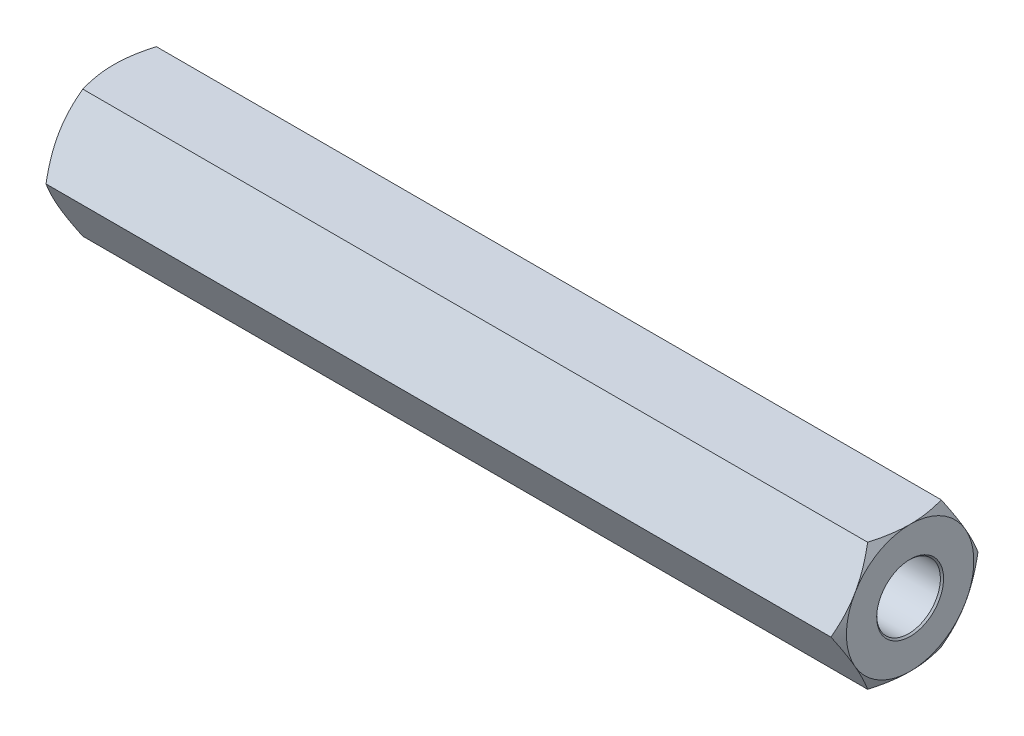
from build123d import *

# Parameters (mm, degrees)
BOSS_EXTRUDE1_DEPTH = 50
SKETCH4_OUTSIDE_W   = 199.49
SKETCH4_OUTSIDE_H   = 198.252
SKETCH4_OUTSIDE_R   = 4
CUT_EXTRUDE1_DEPTH  = 51.371949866
CUT_EXTRUDE1_DRAFT  = -60
SKETCH5_OUTSIDE_W   = 199.49
SKETCH5_OUTSIDE_H   = 198.252
SKETCH5_OUTSIDE_R   = 4
CUT_EXTRUDE2_DEPTH  = 51.371949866
CUT_EXTRUDE2_DRAFT  = -60


with BuildPart() as part:
    # Sketch2 → Boss-Extrude1 (new body)
    with BuildSketch(Plane(origin=(0, 0, 0), x_dir=(0, 0, -1), z_dir=(1, 0, 0))):
        Polygon((2.309401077, 4), (-2.309401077, 4), (-4.618802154, 0), (-2.309401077, -4), (2.309401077, -4), (4.618802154, 0), align=None)
    extrude(amount=BOSS_EXTRUDE1_DEPTH)

    # Sketch3 → Cut-Revolve1 (revolve, cut)
    with BuildSketch(Plane.XY, mode=Mode.PRIVATE) as cut_revolve1_sk:
        Polygon((0, 2.1), (0.1, 2), (11.1, 2), (11.1, 0), (0, 0), align=None)
        Polygon((50, 0), (38.9, 0), (38.9, 2), (49.9, 2), (50, 2.1), align=None)
    revolve(cut_revolve1_sk.sketch.rotate(Axis((0, 0, 0), (1, 0, 0)), 180), axis=Axis((0, 0, 0), (1, 0, 0)), mode=Mode.SUBTRACT)


with BuildPart() as cut_extrude1_tool:
    # Sketch4 outside → Cut-Extrude1 (with draft: the straight prism first)
    with BuildSketch(Plane.ZY):
        Rectangle(SKETCH4_OUTSIDE_W, SKETCH4_OUTSIDE_H)
        Circle(SKETCH4_OUTSIDE_R, mode=Mode.SUBTRACT)
    extrude(amount=-CUT_EXTRUDE1_DEPTH)
    # Cut-Extrude1: the draft: its side faces are tilted about the plane it starts from
    cut_extrude1_sides = [cut_extrude1_tool.faces().sort_by_distance(p)[0] for p in [
        (25.685974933, -99.126, 0),
        (25.685974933, 0, 99.745),
        (25.685974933, 99.126, 0),
        (25.685974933, 0, -99.745),
        (25.685974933, 0, -4),
    ]]
    draft(cut_extrude1_sides, Plane.ZY, CUT_EXTRUDE1_DRAFT)


with BuildPart() as part_1:
    add(part.part)

    # Cut-Extrude1: cut by cut_extrude1_tool
    add(cut_extrude1_tool.part, mode=Mode.SUBTRACT)


with BuildPart() as cut_extrude2_tool:
    # Sketch5 outside → Cut-Extrude2 (with draft: the straight prism first)
    with BuildSketch(Plane(origin=(50, 0, 0), x_dir=(0, 0, -1), z_dir=(1, 0, 0))):
        Rectangle(SKETCH5_OUTSIDE_W, SKETCH5_OUTSIDE_H)
        Circle(SKETCH5_OUTSIDE_R, mode=Mode.SUBTRACT)
    extrude(amount=-CUT_EXTRUDE2_DEPTH)
    # Cut-Extrude2: the draft: its side faces are tilted about the plane it starts from
    cut_extrude2_sides = [cut_extrude2_tool.faces().sort_by_distance(p)[0] for p in [
        (24.314025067, -99.126, 0),
        (24.314025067, 0, -99.745),
        (24.314025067, 99.126, 0),
        (24.314025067, 0, 99.745),
        (24.314025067, 0, 4),
    ]]
    draft(cut_extrude2_sides, Plane(origin=(50, 0, 0), x_dir=(0, 0, -1), z_dir=(1, 0, 0)), CUT_EXTRUDE2_DRAFT)


with BuildPart() as part_2:
    add(part_1.part)

    # Cut-Extrude2: cut by cut_extrude2_tool
    add(cut_extrude2_tool.part, mode=Mode.SUBTRACT)


solid = part_2.part
